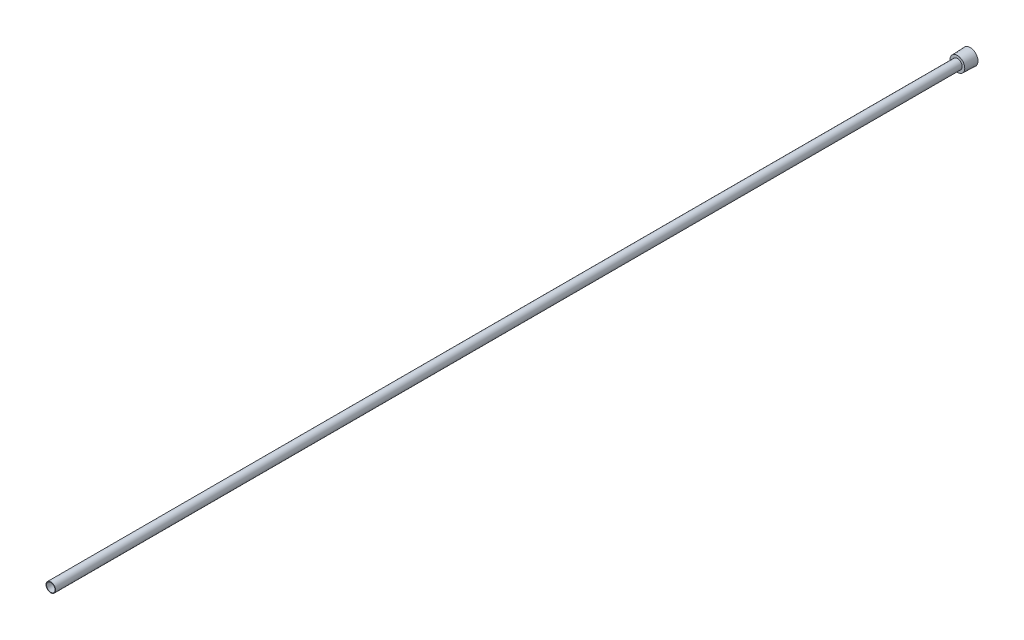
ISO-10303-21;
HEADER;
FILE_DESCRIPTION(('STEP AP214'),'2;1');
FILE_NAME('part.step','',(''),(''),'','','');
FILE_SCHEMA(('AUTOMOTIVE_DESIGN { 1 0 10303 214 1 1 1 1 }'));
ENDSEC;
DATA;
#1=APPLICATION_CONTEXT('core data for automotive mechanical design processes');
#2=APPLICATION_PROTOCOL_DEFINITION('international standard','automotive_design',2000,#1);
#3=PRODUCT_CONTEXT('',#1,'mechanical');
#4=PRODUCT('Part','Part','',(#3));
#5=PRODUCT_RELATED_PRODUCT_CATEGORY('part','',(#4));
#6=PRODUCT_DEFINITION_FORMATION('','',#4);
#7=PRODUCT_DEFINITION_CONTEXT('part definition',#1,'design');
#8=PRODUCT_DEFINITION('design','',#6,#7);
#9=PRODUCT_DEFINITION_SHAPE('','',#8);
#10=(LENGTH_UNIT() NAMED_UNIT(*) SI_UNIT(.MILLI.,.METRE.));
#11=(NAMED_UNIT(*) PLANE_ANGLE_UNIT() SI_UNIT($,.RADIAN.));
#12=(NAMED_UNIT(*) SI_UNIT($,.STERADIAN.) SOLID_ANGLE_UNIT());
#13=UNCERTAINTY_MEASURE_WITH_UNIT(LENGTH_MEASURE(1.E-05),#10,'distance_accuracy_value','');
#14=(GEOMETRIC_REPRESENTATION_CONTEXT(3) GLOBAL_UNCERTAINTY_ASSIGNED_CONTEXT((#13)) GLOBAL_UNIT_ASSIGNED_CONTEXT((#10,
#11,#12)) REPRESENTATION_CONTEXT('',''));
#15=CARTESIAN_POINT('',(0.,0.,0.));
#16=DIRECTION('',(0.,0.,1.));
#17=DIRECTION('',(1.,0.,0.));
#18=AXIS2_PLACEMENT_3D('',#15,#16,#17);
#19=CARTESIAN_POINT('',(0.,0.,0.));
#20=DIRECTION('',(0.,0.,1.));
#21=DIRECTION('',(1.,0.,0.));
#22=AXIS2_PLACEMENT_3D('',#19,#20,#21);
#23=CYLINDRICAL_SURFACE('',#22,2.1209);
#24=CARTESIAN_POINT('',(0.,0.,457.2));
#25=DIRECTION('',(0.,0.,1.));
#26=DIRECTION('',(1.,0.,0.));
#27=AXIS2_PLACEMENT_3D('',#24,#25,#26);
#28=CIRCLE('',#27,2.1209);
#29=CARTESIAN_POINT('',(2.1209,0.,457.2));
#30=VERTEX_POINT('',#29);
#31=EDGE_CURVE('E142',#30,#30,#28,.T.);
#32=ORIENTED_EDGE('',*,*,#31,.T.);
#33=EDGE_LOOP('',(#32));
#34=FACE_BOUND('',#33,.T.);
#35=CARTESIAN_POINT('',(0.,0.,3.96875));
#36=DIRECTION('',(0.,0.,-1.));
#37=DIRECTION('',(-1.,0.,0.));
#38=AXIS2_PLACEMENT_3D('',#35,#36,#37);
#39=CIRCLE('',#38,2.1209);
#40=CARTESIAN_POINT('',(-2.1209,0.,3.96875));
#41=VERTEX_POINT('',#40);
#42=EDGE_CURVE('E37',#41,#41,#39,.F.);
#43=ORIENTED_EDGE('',*,*,#42,.F.);
#44=EDGE_LOOP('',(#43));
#45=FACE_BOUND('',#44,.T.);
#46=ADVANCED_FACE('F33',(#34,#45),#23,.F.);
#47=CARTESIAN_POINT('',(0.,0.,0.));
#48=DIRECTION('',(0.,0.,1.));
#49=DIRECTION('',(1.,0.,0.));
#50=AXIS2_PLACEMENT_3D('',#47,#48,#49);
#51=PLANE('',#50);
#52=DIRECTION('',(-0.866025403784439,0.5,0.));
#53=VECTOR('',#52,1.);
#54=CARTESIAN_POINT('',(0.,-2.74963065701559,0.));
#55=LINE('',#54,#53);
#56=CARTESIAN_POINT('',(0.,-2.74963065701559,0.));
#57=VERTEX_POINT('',#56);
#58=CARTESIAN_POINT('',(-2.38125,-1.3748153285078,0.));
#59=VERTEX_POINT('',#58);
#60=EDGE_CURVE('E124',#57,#59,#55,.T.);
#61=ORIENTED_EDGE('',*,*,#60,.F.);
#62=DIRECTION('',(-0.866025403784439,-0.5,0.));
#63=VECTOR('',#62,1.);
#64=CARTESIAN_POINT('',(2.38125,-1.3748153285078,0.));
#65=LINE('',#64,#63);
#66=CARTESIAN_POINT('',(2.38125,-1.3748153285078,0.));
#67=VERTEX_POINT('',#66);
#68=EDGE_CURVE('E49',#67,#57,#65,.T.);
#69=ORIENTED_EDGE('',*,*,#68,.F.);
#70=DIRECTION('',(0.,-1.,0.));
#71=VECTOR('',#70,1.);
#72=CARTESIAN_POINT('',(2.38125,1.3748153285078,0.));
#73=LINE('',#72,#71);
#74=CARTESIAN_POINT('',(2.38125,1.3748153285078,0.));
#75=VERTEX_POINT('',#74);
#76=EDGE_CURVE('E133',#75,#67,#73,.T.);
#77=ORIENTED_EDGE('',*,*,#76,.F.);
#78=DIRECTION('',(0.866025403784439,-0.5,0.));
#79=VECTOR('',#78,1.);
#80=CARTESIAN_POINT('',(0.,2.74963065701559,0.));
#81=LINE('',#80,#79);
#82=CARTESIAN_POINT('',(0.,2.74963065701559,0.));
#83=VERTEX_POINT('',#82);
#84=EDGE_CURVE('E131',#83,#75,#81,.T.);
#85=ORIENTED_EDGE('',*,*,#84,.F.);
#86=DIRECTION('',(0.866025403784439,0.5,0.));
#87=VECTOR('',#86,1.);
#88=CARTESIAN_POINT('',(-2.38125,1.3748153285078,0.));
#89=LINE('',#88,#87);
#90=CARTESIAN_POINT('',(-2.38125,1.3748153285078,0.));
#91=VERTEX_POINT('',#90);
#92=EDGE_CURVE('E97',#91,#83,#89,.T.);
#93=ORIENTED_EDGE('',*,*,#92,.F.);
#94=DIRECTION('',(0.,1.,0.));
#95=VECTOR('',#94,1.);
#96=CARTESIAN_POINT('',(-2.38125,-1.3748153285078,0.));
#97=LINE('',#96,#95);
#98=EDGE_CURVE('E127',#59,#91,#97,.T.);
#99=ORIENTED_EDGE('',*,*,#98,.F.);
#100=EDGE_LOOP('',(#61,#69,#77,#85,#93,#99));
#101=FACE_BOUND('',#100,.T.);
#102=CARTESIAN_POINT('',(0.,0.,0.));
#103=DIRECTION('',(0.,0.,1.));
#104=DIRECTION('',(1.,0.,0.));
#105=AXIS2_PLACEMENT_3D('',#102,#103,#104);
#106=CIRCLE('',#105,3.8989);
#107=CARTESIAN_POINT('',(3.8989,0.,0.));
#108=VERTEX_POINT('',#107);
#109=EDGE_CURVE('E11',#108,#108,#106,.T.);
#110=ORIENTED_EDGE('',*,*,#109,.F.);
#111=EDGE_LOOP('',(#110));
#112=FACE_BOUND('',#111,.T.);
#113=ADVANCED_FACE('F35',(#101,#112),#51,.F.);
#114=CARTESIAN_POINT('',(0.,0.,0.));
#115=DIRECTION('',(0.,0.,-1.));
#116=DIRECTION('',(-1.,0.,0.));
#117=AXIS2_PLACEMENT_3D('',#114,#115,#116);
#118=CONICAL_SURFACE('',#117,3.8989,0.0364424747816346);
#119=CARTESIAN_POINT('',(0.,0.,6.35));
#120=DIRECTION('',(0.,0.,1.));
#121=DIRECTION('',(1.,0.,0.));
#122=AXIS2_PLACEMENT_3D('',#119,#120,#121);
#123=CIRCLE('',#122,3.66738778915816);
#124=CARTESIAN_POINT('',(3.66738778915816,0.,6.35));
#125=VERTEX_POINT('',#124);
#126=EDGE_CURVE('E42',#125,#125,#123,.T.);
#127=ORIENTED_EDGE('',*,*,#126,.F.);
#128=EDGE_LOOP('',(#127));
#129=FACE_BOUND('',#128,.T.);
#130=ORIENTED_EDGE('',*,*,#109,.T.);
#131=EDGE_LOOP('',(#130));
#132=FACE_BOUND('',#131,.T.);
#133=ADVANCED_FACE('F156',(#129,#132),#118,.T.);
#134=CARTESIAN_POINT('',(0.,3.66738778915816,6.35));
#135=DIRECTION('',(0.,0.,-1.));
#136=DIRECTION('',(-1.,0.,0.));
#137=AXIS2_PLACEMENT_3D('',#134,#135,#136);
#138=PLANE('',#137);
#139=CARTESIAN_POINT('',(0.,0.,6.35));
#140=DIRECTION('',(0.,0.,1.));
#141=DIRECTION('',(1.,0.,0.));
#142=AXIS2_PLACEMENT_3D('',#139,#140,#141);
#143=CIRCLE('',#142,2.3749);
#144=CARTESIAN_POINT('',(2.3749,0.,6.35));
#145=VERTEX_POINT('',#144);
#146=EDGE_CURVE('E148',#145,#145,#143,.T.);
#147=ORIENTED_EDGE('',*,*,#146,.F.);
#148=EDGE_LOOP('',(#147));
#149=FACE_BOUND('',#148,.T.);
#150=ORIENTED_EDGE('',*,*,#126,.T.);
#151=EDGE_LOOP('',(#150));
#152=FACE_BOUND('',#151,.T.);
#153=ADVANCED_FACE('F154',(#149,#152),#138,.F.);
#154=CARTESIAN_POINT('',(0.,0.,0.));
#155=DIRECTION('',(0.,0.,1.));
#156=DIRECTION('',(1.,0.,0.));
#157=AXIS2_PLACEMENT_3D('',#154,#155,#156);
#158=CYLINDRICAL_SURFACE('',#157,2.37489999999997);
#159=CARTESIAN_POINT('',(0.,0.,457.2));
#160=DIRECTION('',(0.,0.,1.));
#161=DIRECTION('',(1.,0.,0.));
#162=AXIS2_PLACEMENT_3D('',#159,#160,#161);
#163=CIRCLE('',#162,2.37489999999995);
#164=CARTESIAN_POINT('',(2.37489999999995,0.,457.2));
#165=VERTEX_POINT('',#164);
#166=EDGE_CURVE('E145',#165,#165,#163,.T.);
#167=ORIENTED_EDGE('',*,*,#166,.F.);
#168=EDGE_LOOP('',(#167));
#169=FACE_BOUND('',#168,.T.);
#170=ORIENTED_EDGE('',*,*,#146,.T.);
#171=EDGE_LOOP('',(#170));
#172=FACE_BOUND('',#171,.T.);
#173=ADVANCED_FACE('F190',(#169,#172),#158,.T.);
#174=CARTESIAN_POINT('',(0.,2.37489999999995,457.2));
#175=DIRECTION('',(0.,0.,-1.));
#176=DIRECTION('',(-1.,0.,0.));
#177=AXIS2_PLACEMENT_3D('',#174,#175,#176);
#178=PLANE('',#177);
#179=ORIENTED_EDGE('',*,*,#31,.F.);
#180=EDGE_LOOP('',(#179));
#181=FACE_BOUND('',#180,.T.);
#182=ORIENTED_EDGE('',*,*,#166,.T.);
#183=EDGE_LOOP('',(#182));
#184=FACE_BOUND('',#183,.T.);
#185=ADVANCED_FACE('F183',(#181,#184),#178,.F.);
#186=CARTESIAN_POINT('',(0.,-2.74963065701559,3.96875));
#187=DIRECTION('',(0.,0.,-1.));
#188=DIRECTION('',(-1.,0.,0.));
#189=AXIS2_PLACEMENT_3D('',#186,#187,#188);
#190=PLANE('',#189);
#191=DIRECTION('',(-0.866025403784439,-0.5,0.));
#192=VECTOR('',#191,1.);
#193=CARTESIAN_POINT('',(2.38125,-1.3748153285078,3.96875));
#194=LINE('',#193,#192);
#195=CARTESIAN_POINT('',(2.38125,-1.3748153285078,3.96875));
#196=VERTEX_POINT('',#195);
#197=CARTESIAN_POINT('',(0.,-2.74963065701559,3.96875));
#198=VERTEX_POINT('',#197);
#199=EDGE_CURVE('E135',#196,#198,#194,.T.);
#200=ORIENTED_EDGE('',*,*,#199,.T.);
#201=DIRECTION('',(-0.866025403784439,0.5,0.));
#202=VECTOR('',#201,1.);
#203=CARTESIAN_POINT('',(0.,-2.74963065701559,3.96875));
#204=LINE('',#203,#202);
#205=CARTESIAN_POINT('',(-2.38125,-1.3748153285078,3.96875));
#206=VERTEX_POINT('',#205);
#207=EDGE_CURVE('E118',#198,#206,#204,.T.);
#208=ORIENTED_EDGE('',*,*,#207,.T.);
#209=DIRECTION('',(0.,1.,0.));
#210=VECTOR('',#209,1.);
#211=CARTESIAN_POINT('',(-2.38125,-1.3748153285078,3.96875));
#212=LINE('',#211,#210);
#213=CARTESIAN_POINT('',(-2.38125,1.3748153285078,3.96875));
#214=VERTEX_POINT('',#213);
#215=EDGE_CURVE('E116',#206,#214,#212,.T.);
#216=ORIENTED_EDGE('',*,*,#215,.T.);
#217=DIRECTION('',(0.866025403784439,0.5,0.));
#218=VECTOR('',#217,1.);
#219=CARTESIAN_POINT('',(-2.38125,1.3748153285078,3.96875));
#220=LINE('',#219,#218);
#221=CARTESIAN_POINT('',(0.,2.74963065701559,3.96875));
#222=VERTEX_POINT('',#221);
#223=EDGE_CURVE('E94',#214,#222,#220,.T.);
#224=ORIENTED_EDGE('',*,*,#223,.T.);
#225=DIRECTION('',(0.866025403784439,-0.5,0.));
#226=VECTOR('',#225,1.);
#227=CARTESIAN_POINT('',(0.,2.74963065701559,3.96875));
#228=LINE('',#227,#226);
#229=CARTESIAN_POINT('',(2.38125,1.3748153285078,3.96875));
#230=VERTEX_POINT('',#229);
#231=EDGE_CURVE('E105',#222,#230,#228,.T.);
#232=ORIENTED_EDGE('',*,*,#231,.T.);
#233=DIRECTION('',(0.,-1.,0.));
#234=VECTOR('',#233,1.);
#235=CARTESIAN_POINT('',(2.38125,1.3748153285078,3.96875));
#236=LINE('',#235,#234);
#237=EDGE_CURVE('E109',#230,#196,#236,.T.);
#238=ORIENTED_EDGE('',*,*,#237,.T.);
#239=EDGE_LOOP('',(#200,#208,#216,#224,#232,#238));
#240=FACE_BOUND('',#239,.T.);
#241=ORIENTED_EDGE('',*,*,#42,.T.);
#242=EDGE_LOOP('',(#241));
#243=FACE_BOUND('',#242,.T.);
#244=ADVANCED_FACE('F112',(#240,#243),#190,.T.);
#245=CARTESIAN_POINT('',(2.38125,-1.3748153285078,3.96875));
#246=DIRECTION('',(0.5,-0.866025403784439,0.));
#247=DIRECTION('',(0.866025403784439,0.5,0.));
#248=AXIS2_PLACEMENT_3D('',#245,#246,#247);
#249=PLANE('',#248);
#250=ORIENTED_EDGE('',*,*,#68,.T.);
#251=DIRECTION('',(0.,0.,-1.));
#252=VECTOR('',#251,1.);
#253=CARTESIAN_POINT('',(0.,-2.74963065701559,3.96875));
#254=LINE('',#253,#252);
#255=EDGE_CURVE('E79',#198,#57,#254,.T.);
#256=ORIENTED_EDGE('',*,*,#255,.F.);
#257=ORIENTED_EDGE('',*,*,#199,.F.);
#258=DIRECTION('',(0.,0.,-1.));
#259=VECTOR('',#258,1.);
#260=CARTESIAN_POINT('',(2.38125,-1.3748153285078,3.96875));
#261=LINE('',#260,#259);
#262=EDGE_CURVE('E57',#196,#67,#261,.T.);
#263=ORIENTED_EDGE('',*,*,#262,.T.);
#264=EDGE_LOOP('',(#250,#256,#257,#263));
#265=FACE_BOUND('',#264,.T.);
#266=ADVANCED_FACE('F174',(#265),#249,.F.);
#267=CARTESIAN_POINT('',(2.38125,1.3748153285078,3.96875));
#268=DIRECTION('',(1.,0.,0.));
#269=DIRECTION('',(0.,0.,-1.));
#270=AXIS2_PLACEMENT_3D('',#267,#268,#269);
#271=PLANE('',#270);
#272=ORIENTED_EDGE('',*,*,#76,.T.);
#273=ORIENTED_EDGE('',*,*,#262,.F.);
#274=ORIENTED_EDGE('',*,*,#237,.F.);
#275=DIRECTION('',(0.,0.,-1.));
#276=VECTOR('',#275,1.);
#277=CARTESIAN_POINT('',(2.38125,1.3748153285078,3.96875));
#278=LINE('',#277,#276);
#279=EDGE_CURVE('E101',#230,#75,#278,.T.);
#280=ORIENTED_EDGE('',*,*,#279,.T.);
#281=EDGE_LOOP('',(#272,#273,#274,#280));
#282=FACE_BOUND('',#281,.T.);
#283=ADVANCED_FACE('F176',(#282),#271,.F.);
#284=CARTESIAN_POINT('',(0.,2.74963065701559,3.96875));
#285=DIRECTION('',(0.5,0.866025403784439,0.));
#286=DIRECTION('',(-0.866025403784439,0.5,0.));
#287=AXIS2_PLACEMENT_3D('',#284,#285,#286);
#288=PLANE('',#287);
#289=ORIENTED_EDGE('',*,*,#84,.T.);
#290=ORIENTED_EDGE('',*,*,#279,.F.);
#291=ORIENTED_EDGE('',*,*,#231,.F.);
#292=DIRECTION('',(0.,0.,-1.));
#293=VECTOR('',#292,1.);
#294=CARTESIAN_POINT('',(0.,2.74963065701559,3.96875));
#295=LINE('',#294,#293);
#296=EDGE_CURVE('E90',#222,#83,#295,.T.);
#297=ORIENTED_EDGE('',*,*,#296,.T.);
#298=EDGE_LOOP('',(#289,#290,#291,#297));
#299=FACE_BOUND('',#298,.T.);
#300=ADVANCED_FACE('F106',(#299),#288,.F.);
#301=CARTESIAN_POINT('',(-2.38125,1.3748153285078,3.96875));
#302=DIRECTION('',(-0.5,0.866025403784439,0.));
#303=DIRECTION('',(-0.866025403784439,-0.5,0.));
#304=AXIS2_PLACEMENT_3D('',#301,#302,#303);
#305=PLANE('',#304);
#306=ORIENTED_EDGE('',*,*,#92,.T.);
#307=ORIENTED_EDGE('',*,*,#296,.F.);
#308=ORIENTED_EDGE('',*,*,#223,.F.);
#309=DIRECTION('',(0.,0.,-1.));
#310=VECTOR('',#309,1.);
#311=CARTESIAN_POINT('',(-2.38125,1.3748153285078,3.96875));
#312=LINE('',#311,#310);
#313=EDGE_CURVE('E102',#214,#91,#312,.T.);
#314=ORIENTED_EDGE('',*,*,#313,.T.);
#315=EDGE_LOOP('',(#306,#307,#308,#314));
#316=FACE_BOUND('',#315,.T.);
#317=ADVANCED_FACE('F92',(#316),#305,.F.);
#318=CARTESIAN_POINT('',(-2.38125,-1.3748153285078,3.96875));
#319=DIRECTION('',(-1.,0.,0.));
#320=DIRECTION('',(0.,0.,1.));
#321=AXIS2_PLACEMENT_3D('',#318,#319,#320);
#322=PLANE('',#321);
#323=ORIENTED_EDGE('',*,*,#98,.T.);
#324=ORIENTED_EDGE('',*,*,#313,.F.);
#325=ORIENTED_EDGE('',*,*,#215,.F.);
#326=DIRECTION('',(0.,0.,-1.));
#327=VECTOR('',#326,1.);
#328=CARTESIAN_POINT('',(-2.38125,-1.3748153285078,3.96875));
#329=LINE('',#328,#327);
#330=EDGE_CURVE('E139',#206,#59,#329,.T.);
#331=ORIENTED_EDGE('',*,*,#330,.T.);
#332=EDGE_LOOP('',(#323,#324,#325,#331));
#333=FACE_BOUND('',#332,.T.);
#334=ADVANCED_FACE('F246',(#333),#322,.F.);
#335=CARTESIAN_POINT('',(0.,-2.74963065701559,3.96875));
#336=DIRECTION('',(-0.5,-0.866025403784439,0.));
#337=DIRECTION('',(0.866025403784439,-0.5,0.));
#338=AXIS2_PLACEMENT_3D('',#335,#336,#337);
#339=PLANE('',#338);
#340=ORIENTED_EDGE('',*,*,#60,.T.);
#341=ORIENTED_EDGE('',*,*,#330,.F.);
#342=ORIENTED_EDGE('',*,*,#207,.F.);
#343=ORIENTED_EDGE('',*,*,#255,.T.);
#344=EDGE_LOOP('',(#340,#341,#342,#343));
#345=FACE_BOUND('',#344,.T.);
#346=ADVANCED_FACE('F172',(#345),#339,.F.);
#347=CLOSED_SHELL('',(#46,#113,#133,#153,#173,#185,#244,#266,#283,#300,#317,#334,#346));
#348=MANIFOLD_SOLID_BREP('B2',#347);
#349=ADVANCED_BREP_SHAPE_REPRESENTATION('',(#18,#348),#14);
#350=SHAPE_DEFINITION_REPRESENTATION(#9,#349);
ENDSEC;
END-ISO-10303-21;
